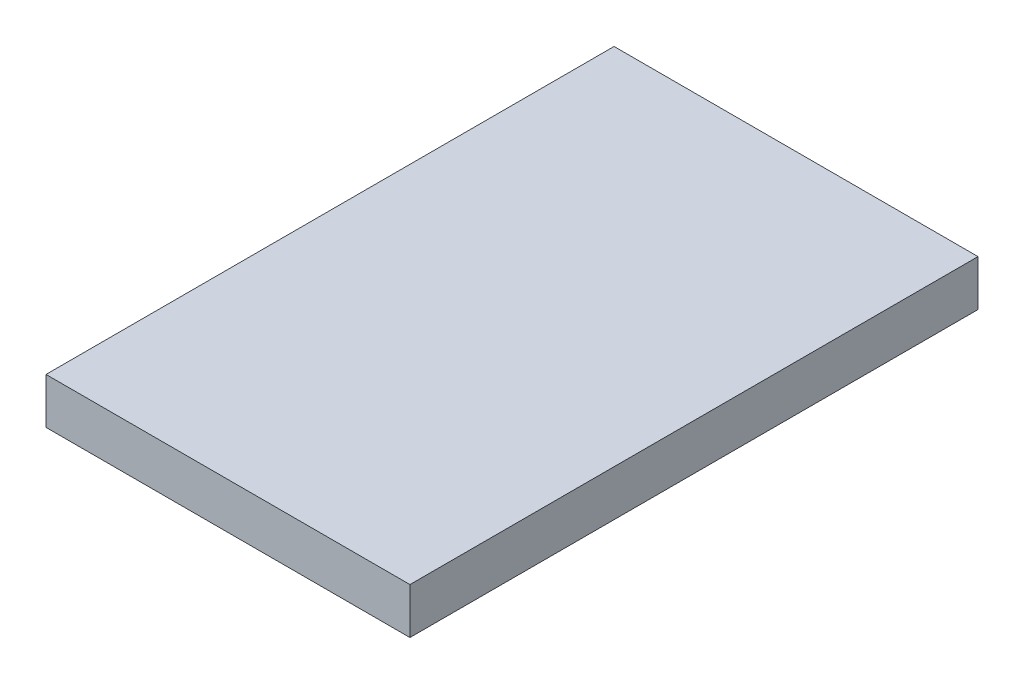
ISO-10303-21;
HEADER;
FILE_DESCRIPTION(('STEP AP214'),'2;1');
FILE_NAME('part.step','',(''),(''),'','','');
FILE_SCHEMA(('AUTOMOTIVE_DESIGN { 1 0 10303 214 1 1 1 1 }'));
ENDSEC;
DATA;
#1=APPLICATION_CONTEXT('core data for automotive mechanical design processes');
#2=APPLICATION_PROTOCOL_DEFINITION('international standard','automotive_design',2000,#1);
#3=PRODUCT_CONTEXT('',#1,'mechanical');
#4=PRODUCT('Part','Part','',(#3));
#5=PRODUCT_RELATED_PRODUCT_CATEGORY('part','',(#4));
#6=PRODUCT_DEFINITION_FORMATION('','',#4);
#7=PRODUCT_DEFINITION_CONTEXT('part definition',#1,'design');
#8=PRODUCT_DEFINITION('design','',#6,#7);
#9=PRODUCT_DEFINITION_SHAPE('','',#8);
#10=(LENGTH_UNIT() NAMED_UNIT(*) SI_UNIT(.MILLI.,.METRE.));
#11=(NAMED_UNIT(*) PLANE_ANGLE_UNIT() SI_UNIT($,.RADIAN.));
#12=(NAMED_UNIT(*) SI_UNIT($,.STERADIAN.) SOLID_ANGLE_UNIT());
#13=UNCERTAINTY_MEASURE_WITH_UNIT(LENGTH_MEASURE(1.E-05),#10,'distance_accuracy_value','');
#14=(GEOMETRIC_REPRESENTATION_CONTEXT(3) GLOBAL_UNCERTAINTY_ASSIGNED_CONTEXT((#13)) GLOBAL_UNIT_ASSIGNED_CONTEXT((#10,
#11,#12)) REPRESENTATION_CONTEXT('',''));
#15=CARTESIAN_POINT('',(0.,0.,0.));
#16=DIRECTION('',(0.,0.,1.));
#17=DIRECTION('',(1.,0.,0.));
#18=AXIS2_PLACEMENT_3D('',#15,#16,#17);
#19=CARTESIAN_POINT('',(-44.8838783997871,11.3189883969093,-70.0583773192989));
#20=DIRECTION('',(1.,0.,0.));
#21=DIRECTION('',(0.,0.,-1.));
#22=AXIS2_PLACEMENT_3D('',#19,#20,#21);
#23=PLANE('',#22);
#24=DIRECTION('',(0.,0.,1.));
#25=VECTOR('',#24,1.);
#26=CARTESIAN_POINT('',(-44.8838783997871,0.,-70.0583773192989));
#27=LINE('',#26,#25);
#28=CARTESIAN_POINT('',(-44.8838783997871,0.,-70.0583773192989));
#29=VERTEX_POINT('',#28);
#30=CARTESIAN_POINT('',(-44.8838783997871,0.,70.0583773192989));
#31=VERTEX_POINT('',#30);
#32=EDGE_CURVE('E70',#29,#31,#27,.T.);
#33=ORIENTED_EDGE('',*,*,#32,.T.);
#34=DIRECTION('',(0.,-1.,0.));
#35=VECTOR('',#34,1.);
#36=CARTESIAN_POINT('',(-44.8838783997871,11.3189883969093,70.0583773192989));
#37=LINE('',#36,#35);
#38=CARTESIAN_POINT('',(-44.8838783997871,11.3189883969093,70.0583773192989));
#39=VERTEX_POINT('',#38);
#40=EDGE_CURVE('E11',#39,#31,#37,.T.);
#41=ORIENTED_EDGE('',*,*,#40,.F.);
#42=DIRECTION('',(0.,0.,1.));
#43=VECTOR('',#42,1.);
#44=CARTESIAN_POINT('',(-44.8838783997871,11.3189883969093,-70.0583773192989));
#45=LINE('',#44,#43);
#46=CARTESIAN_POINT('',(-44.8838783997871,11.3189883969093,-70.0583773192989));
#47=VERTEX_POINT('',#46);
#48=EDGE_CURVE('E88',#47,#39,#45,.T.);
#49=ORIENTED_EDGE('',*,*,#48,.F.);
#50=DIRECTION('',(0.,-1.,0.));
#51=VECTOR('',#50,1.);
#52=CARTESIAN_POINT('',(-44.8838783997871,11.3189883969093,-70.0583773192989));
#53=LINE('',#52,#51);
#54=EDGE_CURVE('E82',#47,#29,#53,.T.);
#55=ORIENTED_EDGE('',*,*,#54,.T.);
#56=EDGE_LOOP('',(#33,#41,#49,#55));
#57=FACE_BOUND('',#56,.T.);
#58=ADVANCED_FACE('F26',(#57),#23,.F.);
#59=CARTESIAN_POINT('',(-44.8838783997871,11.3189883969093,70.0583773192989));
#60=DIRECTION('',(0.,0.,-1.));
#61=DIRECTION('',(-1.,0.,0.));
#62=AXIS2_PLACEMENT_3D('',#59,#60,#61);
#63=PLANE('',#62);
#64=DIRECTION('',(1.,0.,0.));
#65=VECTOR('',#64,1.);
#66=CARTESIAN_POINT('',(-44.8838783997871,0.,70.0583773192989));
#67=LINE('',#66,#65);
#68=CARTESIAN_POINT('',(44.8838783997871,0.,70.0583773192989));
#69=VERTEX_POINT('',#68);
#70=EDGE_CURVE('E66',#31,#69,#67,.T.);
#71=ORIENTED_EDGE('',*,*,#70,.T.);
#72=DIRECTION('',(0.,-1.,0.));
#73=VECTOR('',#72,1.);
#74=CARTESIAN_POINT('',(44.8838783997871,11.3189883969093,70.0583773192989));
#75=LINE('',#74,#73);
#76=CARTESIAN_POINT('',(44.8838783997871,11.3189883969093,70.0583773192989));
#77=VERTEX_POINT('',#76);
#78=EDGE_CURVE('E33',#77,#69,#75,.T.);
#79=ORIENTED_EDGE('',*,*,#78,.F.);
#80=DIRECTION('',(1.,0.,0.));
#81=VECTOR('',#80,1.);
#82=CARTESIAN_POINT('',(-44.8838783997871,11.3189883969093,70.0583773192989));
#83=LINE('',#82,#81);
#84=EDGE_CURVE('E78',#39,#77,#83,.T.);
#85=ORIENTED_EDGE('',*,*,#84,.F.);
#86=ORIENTED_EDGE('',*,*,#40,.T.);
#87=EDGE_LOOP('',(#71,#79,#85,#86));
#88=FACE_BOUND('',#87,.T.);
#89=ADVANCED_FACE('F77',(#88),#63,.F.);
#90=CARTESIAN_POINT('',(44.8838783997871,11.3189883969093,-70.0583773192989));
#91=DIRECTION('',(-1.,0.,0.));
#92=DIRECTION('',(0.,0.,1.));
#93=AXIS2_PLACEMENT_3D('',#90,#91,#92);
#94=PLANE('',#93);
#95=DIRECTION('',(0.,0.,-1.));
#96=VECTOR('',#95,1.);
#97=CARTESIAN_POINT('',(44.8838783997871,0.,-70.0583773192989));
#98=LINE('',#97,#96);
#99=CARTESIAN_POINT('',(44.8838783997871,0.,-70.0583773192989));
#100=VERTEX_POINT('',#99);
#101=EDGE_CURVE('E71',#69,#100,#98,.T.);
#102=ORIENTED_EDGE('',*,*,#101,.T.);
#103=DIRECTION('',(0.,-1.,0.));
#104=VECTOR('',#103,1.);
#105=CARTESIAN_POINT('',(44.8838783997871,11.3189883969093,-70.0583773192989));
#106=LINE('',#105,#104);
#107=CARTESIAN_POINT('',(44.8838783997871,11.3189883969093,-70.0583773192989));
#108=VERTEX_POINT('',#107);
#109=EDGE_CURVE('E94',#108,#100,#106,.T.);
#110=ORIENTED_EDGE('',*,*,#109,.F.);
#111=DIRECTION('',(0.,0.,-1.));
#112=VECTOR('',#111,1.);
#113=CARTESIAN_POINT('',(44.8838783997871,11.3189883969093,-70.0583773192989));
#114=LINE('',#113,#112);
#115=EDGE_CURVE('E45',#77,#108,#114,.T.);
#116=ORIENTED_EDGE('',*,*,#115,.F.);
#117=ORIENTED_EDGE('',*,*,#78,.T.);
#118=EDGE_LOOP('',(#102,#110,#116,#117));
#119=FACE_BOUND('',#118,.T.);
#120=ADVANCED_FACE('F97',(#119),#94,.F.);
#121=CARTESIAN_POINT('',(-44.8838783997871,11.3189883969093,-70.0583773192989));
#122=DIRECTION('',(0.,0.,1.));
#123=DIRECTION('',(1.,0.,0.));
#124=AXIS2_PLACEMENT_3D('',#121,#122,#123);
#125=PLANE('',#124);
#126=DIRECTION('',(-1.,0.,0.));
#127=VECTOR('',#126,1.);
#128=CARTESIAN_POINT('',(-44.8838783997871,0.,-70.0583773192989));
#129=LINE('',#128,#127);
#130=EDGE_CURVE('E86',#100,#29,#129,.T.);
#131=ORIENTED_EDGE('',*,*,#130,.T.);
#132=ORIENTED_EDGE('',*,*,#54,.F.);
#133=DIRECTION('',(-1.,0.,0.));
#134=VECTOR('',#133,1.);
#135=CARTESIAN_POINT('',(-44.8838783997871,11.3189883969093,-70.0583773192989));
#136=LINE('',#135,#134);
#137=EDGE_CURVE('E40',#108,#47,#136,.T.);
#138=ORIENTED_EDGE('',*,*,#137,.F.);
#139=ORIENTED_EDGE('',*,*,#109,.T.);
#140=EDGE_LOOP('',(#131,#132,#138,#139));
#141=FACE_BOUND('',#140,.T.);
#142=ADVANCED_FACE('F99',(#141),#125,.F.);
#143=CARTESIAN_POINT('',(-44.8838783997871,11.3189883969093,70.0583773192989));
#144=DIRECTION('',(0.,1.,0.));
#145=DIRECTION('',(0.,0.,1.));
#146=AXIS2_PLACEMENT_3D('',#143,#144,#145);
#147=PLANE('',#146);
#148=ORIENTED_EDGE('',*,*,#48,.T.);
#149=ORIENTED_EDGE('',*,*,#84,.T.);
#150=ORIENTED_EDGE('',*,*,#115,.T.);
#151=ORIENTED_EDGE('',*,*,#137,.T.);
#152=EDGE_LOOP('',(#148,#149,#150,#151));
#153=FACE_BOUND('',#152,.T.);
#154=ADVANCED_FACE('F100',(#153),#147,.T.);
#155=CARTESIAN_POINT('',(-44.8838783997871,0.,70.0583773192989));
#156=DIRECTION('',(0.,1.,0.));
#157=DIRECTION('',(0.,0.,1.));
#158=AXIS2_PLACEMENT_3D('',#155,#156,#157);
#159=PLANE('',#158);
#160=ORIENTED_EDGE('',*,*,#32,.F.);
#161=ORIENTED_EDGE('',*,*,#130,.F.);
#162=ORIENTED_EDGE('',*,*,#101,.F.);
#163=ORIENTED_EDGE('',*,*,#70,.F.);
#164=EDGE_LOOP('',(#160,#161,#162,#163));
#165=FACE_BOUND('',#164,.T.);
#166=ADVANCED_FACE('F67',(#165),#159,.F.);
#167=CLOSED_SHELL('',(#58,#89,#120,#142,#154,#166));
#168=MANIFOLD_SOLID_BREP('B2',#167);
#169=ADVANCED_BREP_SHAPE_REPRESENTATION('',(#18,#168),#14);
#170=SHAPE_DEFINITION_REPRESENTATION(#9,#169);
ENDSEC;
END-ISO-10303-21;
